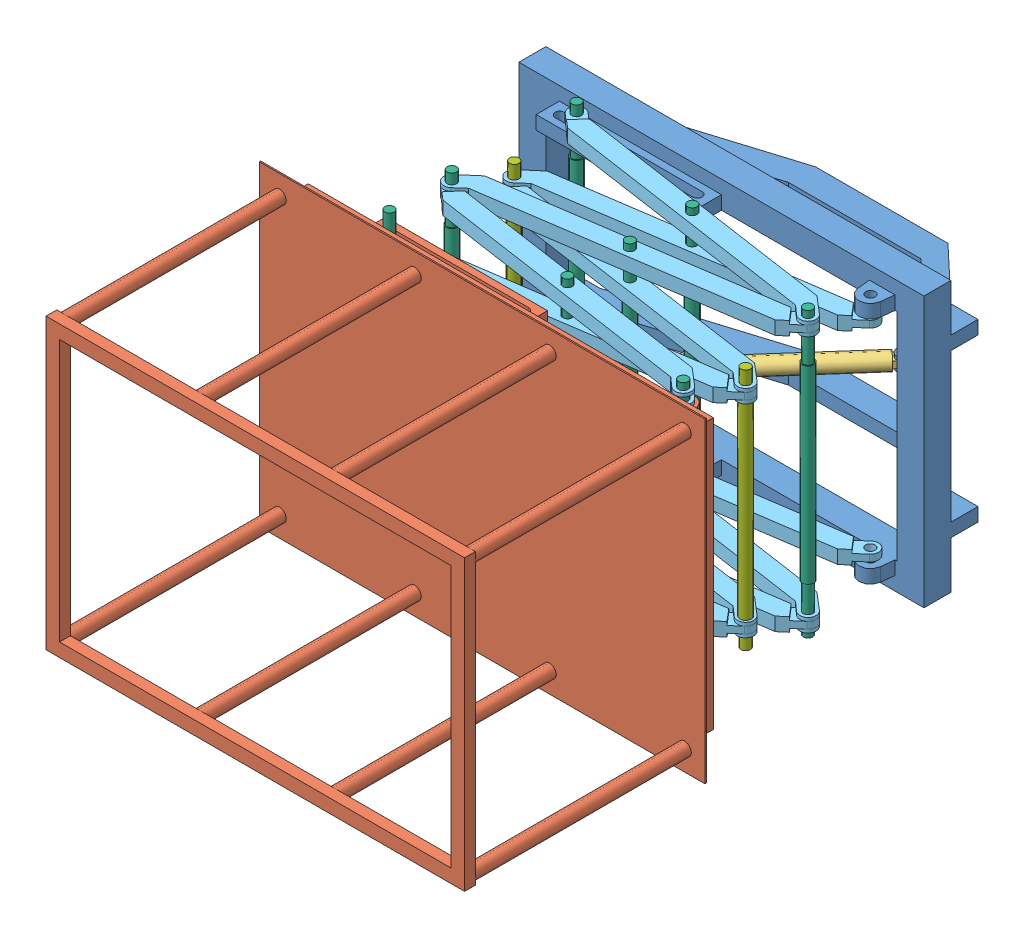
SolidWorks assembly Scissor_Lift.SLDASM, configuration Default (file format 11000). Lengths in mm.
Overall size (3300 2340 4227.19).
32 component instances, 7 part files, 33 mates.
Components (placement in the parent):
- Base-1: Base.SLDPRT [Default] at origin size (3000 2000 949.25)
- platform-1: platform.SLDPRT [Default] at (0 0 1759.9364) x (1 0 0) z (0 0 -1) size (3300 2340 2062)
- cylinder-1: cylinder.SLDPRT [Default] at (795.3045 0 -367.7657) x (-0.661592 0 0.749864) z (0 1 0) size (950 120 120)
- Piston-1: Piston.SLDPRT [Default] at (102.046 0 417.9894) x (-0.661592 0 0.749864) z (0 -1 0) size (775 150 125)
- layer_1-1: layer_1.SLDASM [Default] at (-138.5852 0 -136.0114) x (0.987779 0 -0.15586) z (0.15586 0 0.987779) size (2311.11 2100 945.79)
  - crossarm-1: crossarm.SLDPRT [Default] at (151.3438 950 584.7352) x (0 -1 0) z (-0.954527 0 -0.298125) size (100 260 2340)
  - crossarm-2: crossarm.SLDPRT [Default] at (151.3438 -950 584.7352) x (0 -1 0) z (-0.954527 0 -0.298125) size (100 260 2340)
  - cross_rod-1: cross_rod.SLDPRT [Default] at (-887.3124 0 187) x (0.999014 0 -0.044391) z (0 -1 0) size (85 85 2100)
  - cross_rod-2: cross_rod.SLDPRT [Default] at (1190 0 982.4705) x (1 0 0) z (0 -1 0) size (85 85 2100)
- layer_2-1: layer_2.SLDASM [Default] at (43.6887 0 -183.1884) x (0.987779 0 0.15586) z (-0.15586 0 0.987779) size (2311.11 2100 945.79)
  - crossarm-1: crossarm.SLDPRT [Default] at (151.3438 750 584.7352) x (0 1 0) z (0.954527 0 -0.298125) size (100 260 2340)
  - crossarm-2: crossarm.SLDPRT [Default] at (151.3438 -750 584.7352) x (0 1 0) z (0.954527 0 -0.298125) size (100 260 2340)
  - cross_rod-1: cross_rod.SLDPRT [Default] at (151.3438 0 584.7352) x (-0.66325 0 -0.748398) z (0 1 0) size (85 85 2100)
- layer_3-1: layer_3.SLDASM [Default] at (-262.5674 0 -459.7817) x (0.987779 0 -0.15586) z (0.15586 0 0.987779) size (2311.11 1800 945.79)
  - crossarm-1: crossarm.SLDPRT [Default] at (151.3438 750 1380.2057) x (0 -1 0) z (-0.954527 0 -0.298125) size (100 260 2340)
  - crossarm-2: crossarm.SLDPRT [Default] at (151.3438 -750 1380.2057) x (0 -1 0) z (-0.954527 0 -0.298125) size (100 260 2340)
  - cross_rod_short-1: cross_rod_short.SLDPRT [Default] at (-887.3124 0 982.4705) x (1 0 0) z (0 1 0) size (85 85 1800)
  - cross_rod_short-2: cross_rod_short.SLDPRT [Default] at (1190 0 1777.941) x (1 0 0) z (0 -1 0) size (85 85 1800)
- layer_4-1: layer_4.SLDASM [Default] at (167.6709 0 -506.9587) x (0.987779 0 0.15586) z (-0.15586 0 0.987779) size (2311.11 2100 945.79)
  - crossarm-1: crossarm.SLDPRT [Default] at (151.3438 950 1380.2057) x (0 1 0) z (0.954527 0 -0.298125) size (100 260 2340)
  - crossarm-2: crossarm.SLDPRT [Default] at (151.3438 -950 1380.2057) x (0 1 0) z (0.954527 0 -0.298125) size (100 260 2340)
  - cross_rod-1: cross_rod.SLDPRT [Default] at (151.3438 0 1380.2057) x (1 0 0) z (0 1 0) size (85 85 2100)
- layer_5-1: layer_5.SLDASM [Default] at (-386.5496 0 -783.5521) x (0.987779 0 -0.15586) z (0.15586 0 0.987779) size (2311.11 2125 945.79)
  - crossarm-1: crossarm.SLDPRT [Default] at (151.3438 950 2175.6762) x (0 -1 0) z (-0.954527 0 -0.298125) size (100 260 2340)
  - crossarm-2: crossarm.SLDPRT [Default] at (151.3438 -950 2175.6762) x (0 -1 0) z (-0.954527 0 -0.298125) size (100 260 2340)
  - cross_rod-1: cross_rod.SLDPRT [Default] at (1190 0 2573.4115) x (1 0 0) z (0 -1 0) size (85 85 2100)
  - cross_rod-2: cross_rod.SLDPRT [Default] at (-887.3124 25 1777.941) x (1 0 0) z (0 1 0) size (85 85 2100)
- layer_6-1: layer_6.SLDASM [Default] at (291.6531 0 -830.7291) x (0.987779 0 0.15586) z (-0.15586 0 0.987779) size (2311.11 2105.21 945.79)
  - crossarm-1: crossarm.SLDPRT [Default] at (151.3438 750 2175.6762) x (0 1 0) z (0.954527 0 -0.298125) size (100 260 2340)
  - crossarm-2: crossarm.SLDPRT [Default] at (151.3438 -750 2175.6762) x (0 1 0) z (0.954527 0 -0.298125) size (100 260 2340)
  - cross_rod-3: cross_rod.SLDPRT [Default] at (-887.3124 0 2573.4115) x (0.99771 0 0.067633) z (0 -1 0) size (85 85 2100)
  - cross_rod-2: cross_rod.SLDPRT [Default] at (151.3438 5.2104 2175.6762) x (1 0 0) z (0 1 0) size (85 85 2100)
Mates (geometry in assembly coordinates):
- Concentric16: concentric: cylinder of assembly; cylinder of assembly; cylinder of cylinder-1 through (795.3045 0 -367.7657) axis (0.661592 0 -0.749864) radius 60; cylinder of Piston-1 through (102.046 0 417.9894) axis (-0.661592 0 0.749864) radius 50
- Concentric36: concentric: cylinder of Base-1 through (1190 -900 187) axis (0 1 0) radius 35; cylinder of layer_2-1/crossarm-2 through (1190 -725 187) axis (0 -1 0) radius 35
- Concentric37: concentric: cylinder of Base-1 through (1190 900 187) axis (0 -1 0) radius 35; cylinder of layer_2-1/crossarm-1 through (1190 775 187) axis (0 -1 0) radius 35
- Concentric19: concentric: cylinder of Piston-1 through (102.046 62.5 417.9894) axis (0 -1 0) radius 42.5; cylinder of layer_2-1/cross_rod-1 through (102.046 700 417.9894) axis (0 -1 0) radius 42.5
- Concentric20: concentric: cylinder of layer_1-1/crossarm-2 through (102.046 -900 417.9894) axis (0 -1 0) radius 35; cylinder of layer_2-1/cross_rod-1 through (102.046 1050 417.9894) axis (0 -1 0) radius 35
- Concentric21: concentric: cylinder of layer_1-1/crossarm-1 through (102.046 1000 417.9894) axis (0 -1 0) radius 35; cylinder of layer_2-1/cross_rod-1 through (102.046 1050 417.9894) axis (0 -1 0) radius 35
- Tangent3: tangent: plane of Base-1 through (-1110 -900 152) normal (0 0 1); cylinder of layer_1-1/cross_rod-1 through (-985.908 -1050 187) axis (0 1 0) radius 35
- Tangent4: tangent: plane of Base-1 through (-1110 900 152) normal (0 0 1); cylinder of layer_1-1/cross_rod-1 through (-985.908 -1050 187) axis (0 1 0) radius 35
- Coincident11: coincident: plane of Base-1 through (-1200 -900 100) normal (0 -1 0); plane of layer_1-1/crossarm-2 through (-877.082 -900 203.0279) normal (0 1 0)
- Concentric22: concentric: cylinder of layer_1-1/cross_rod-2 through (1190 -1050 648.9788) axis (0 1 0) radius 35; cylinder of layer_4-1/crossarm-2 through (1190 -925 648.9788) axis (0 -1 0) radius 35
- Concentric23: concentric: cylinder of layer_1-1/cross_rod-2 through (1190 -1050 648.9788) axis (0 1 0) radius 35; cylinder of layer_4-1/crossarm-1 through (1190 975 648.9788) axis (0 -1 0) radius 35
- Coincident15: coincident: plane of layer_1-1/crossarm-2 through (1158.1982 -975 542.854) normal (0 1 0); plane of layer_4-1/crossarm-2 through (1190 -975 648.9788) normal (0 -1 0)
- Concentric24: concentric: cylinder of layer_2-1/crossarm-2 through (-985.908 -800 648.9788) axis (0 1 0) radius 35; cylinder of layer_3-1/cross_rod_short-1 through (-985.908 900 648.9788) axis (0 -1 0) radius 35
- Concentric25: concentric: cylinder of layer_2-1/crossarm-1 through (-985.908 700 648.9788) axis (0 1 0) radius 35; cylinder of layer_3-1/cross_rod_short-1 through (-985.908 900 648.9788) axis (0 -1 0) radius 35
- Coincident16: coincident: plane of layer_2-1/crossarm-2 through (-954.1062 -775 542.854) normal (0 1 0); plane of layer_3-1/crossarm-2 through (-985.908 -775 648.9788) normal (0 -1 0)
- Concentric26: concentric: cylinder of layer_3-1/crossarm-2 through (102.046 -700 879.9682) axis (0 -1 0) radius 35; cylinder of layer_4-1/cross_rod-1 through (102.046 1050 879.9682) axis (0 -1 0) radius 35
- Concentric27: concentric: cylinder of layer_3-1/crossarm-1 through (102.046 800 879.9682) axis (0 -1 0) radius 35; cylinder of layer_4-1/cross_rod-1 through (102.046 1050 879.9682) axis (0 -1 0) radius 35
- Concentric28: concentric: cylinder of layer_3-1/cross_rod_short-2 through (1190 -900 1110.9576) axis (0 1 0) radius 35; cylinder of layer_6-1/crossarm-2 through (1190 -725 1110.9576) axis (0 -1 0) radius 35
- Concentric29: concentric: cylinder of layer_3-1/cross_rod_short-2 through (1190 -900 1110.9576) axis (0 1 0) radius 35; cylinder of layer_6-1/crossarm-1 through (1190 775 1110.9576) axis (0 -1 0) radius 35
- Coincident17: coincident: plane of layer_3-1/crossarm-2 through (1158.1982 -775 1004.8328) normal (0 1 0); plane of layer_6-1/crossarm-2 through (1190 -775 1110.9576) normal (0 -1 0)
- Concentric30: concentric: cylinder of layer_4-1/crossarm-2 through (-985.908 -1000 1110.9576) axis (0 1 0) radius 35; cylinder of layer_5-1/cross_rod-2 through (-985.908 1075 1110.9576) axis (0 -1 0) radius 35
- Concentric31: concentric: cylinder of layer_4-1/crossarm-1 through (-985.908 900 1110.9576) axis (0 1 0) radius 35; cylinder of layer_5-1/cross_rod-2 through (-985.908 1075 1110.9576) axis (0 -1 0) radius 35
- Coincident18: coincident: plane of layer_4-1/crossarm-2 through (-954.1062 -975 1004.8328) normal (0 1 0); plane of layer_5-1/crossarm-2 through (-985.908 -975 1110.9576) normal (0 -1 0)
- Concentric32: concentric: cylinder of layer_5-1/crossarm-2 through (102.046 -900 1341.947) axis (0 -1 0) radius 35; cylinder of layer_6-1/cross_rod-2 through (102.046 1055.2104 1341.947) axis (0 -1 0) radius 35
- Concentric33: concentric: cylinder of layer_5-1/crossarm-1 through (102.046 1110.2082 1341.947) axis (0 -1 0) radius 42.5; cylinder of layer_6-1/cross_rod-2 through (102.046 1055.2104 1341.947) axis (0 -1 0) radius 35
- Concentric34: concentric: cylinder of platform-1 through (1190 -900 1572.9364) axis (0 1 0) radius 35; cylinder of layer_5-1/cross_rod-1 through (1190 -1050 1572.9364) axis (0 1 0) radius 35
- Concentric35: concentric: cylinder of platform-1 through (1190 900 1572.9364) axis (0 -1 0) radius 35; cylinder of layer_5-1/cross_rod-1 through (1190 -1050 1572.9364) axis (0 1 0) radius 35
- Coincident19: coincident: plane of platform-1 through (1190 -900 1572.9364) normal (0 -1 0); plane of layer_5-1/crossarm-2 through (-877.082 -900 1126.9855) normal (0 1 0)
- Tangent6: tangent: cylinder of layer_6-1/cross_rod-3 through (-985.908 -1050 1572.9364) axis (0 1 0) radius 35; plane of platform-1 through (-1010 -900 1537.9364) normal (0 0 1)
- Tangent7: tangent: plane of platform-1 through (-1010 900 1537.9364) normal (0 0 1); cylinder of layer_6-1/cross_rod-3 through (-985.908 -1050 1572.9364) axis (0 1 0) radius 35
- Hinge2: hinge: cylinder of assembly; plane of assembly; cylinder of assembly; plane of assembly; cylinder of cylinder-1 through (835 25 -412.7575) axis (0 -1 0) radius 20; cylinder of Base-1 through (835 50 -412.7575) axis (0 -1 0) radius 22.5; plane of Base-1 through (835 -25 -412.7575) normal (0 1 0); plane of cylinder-1 through (835 -25 -412.7575) normal (0 -1 0)
- Coincident22: coincident: plane of platform-1 through (1190 900 1572.9364) normal (0 1 0); plane of layer_5-1/crossarm-1 through (-897.4812 900 1265.4914) normal (0 -1 0)
- Coincident23: coincident: plane of Base-1 through (-1200 900 100) normal (0 1 0); plane of layer_1-1/crossarm-1 through (-897.4812 900 341.5338) normal (0 -1 0)
